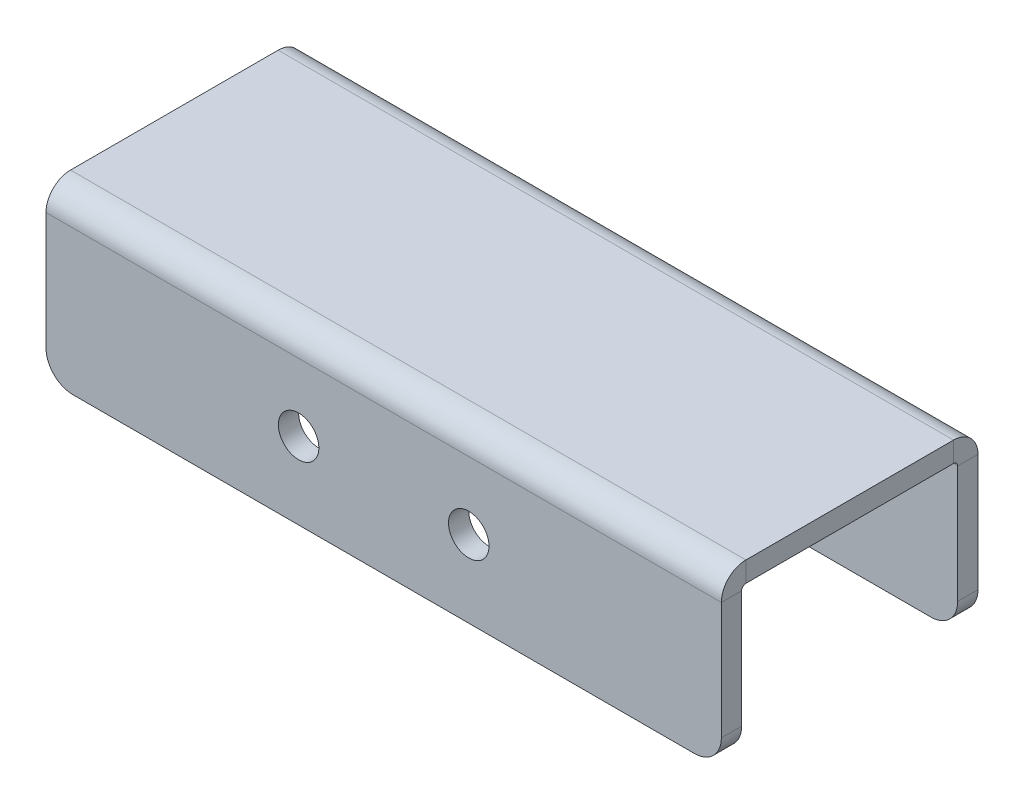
ISO-10303-21;
HEADER;
FILE_DESCRIPTION(('STEP AP214'),'2;1');
FILE_NAME('part.step','',(''),(''),'','','');
FILE_SCHEMA(('AUTOMOTIVE_DESIGN { 1 0 10303 214 1 1 1 1 }'));
ENDSEC;
DATA;
#1=APPLICATION_CONTEXT('core data for automotive mechanical design processes');
#2=APPLICATION_PROTOCOL_DEFINITION('international standard','automotive_design',2000,#1);
#3=PRODUCT_CONTEXT('',#1,'mechanical');
#4=PRODUCT('Part','Part','',(#3));
#5=PRODUCT_RELATED_PRODUCT_CATEGORY('part','',(#4));
#6=PRODUCT_DEFINITION_FORMATION('','',#4);
#7=PRODUCT_DEFINITION_CONTEXT('part definition',#1,'design');
#8=PRODUCT_DEFINITION('design','',#6,#7);
#9=PRODUCT_DEFINITION_SHAPE('','',#8);
#10=(LENGTH_UNIT() NAMED_UNIT(*) SI_UNIT(.MILLI.,.METRE.));
#11=(NAMED_UNIT(*) PLANE_ANGLE_UNIT() SI_UNIT($,.RADIAN.));
#12=(NAMED_UNIT(*) SI_UNIT($,.STERADIAN.) SOLID_ANGLE_UNIT());
#13=UNCERTAINTY_MEASURE_WITH_UNIT(LENGTH_MEASURE(1.E-05),#10,'distance_accuracy_value','');
#14=(GEOMETRIC_REPRESENTATION_CONTEXT(3) GLOBAL_UNCERTAINTY_ASSIGNED_CONTEXT((#13)) GLOBAL_UNIT_ASSIGNED_CONTEXT((#10,
#11,#12)) REPRESENTATION_CONTEXT('',''));
#15=CARTESIAN_POINT('',(0.,0.,0.));
#16=DIRECTION('',(0.,0.,1.));
#17=DIRECTION('',(1.,0.,0.));
#18=AXIS2_PLACEMENT_3D('',#15,#16,#17);
#19=CARTESIAN_POINT('',(414.617830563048,4.09724696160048,365.123365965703));
#20=DIRECTION('',(0.,0.,-1.));
#21=DIRECTION('',(0.,1.,0.));
#22=AXIS2_PLACEMENT_3D('',#19,#20,#21);
#23=CYLINDRICAL_SURFACE('',#22,6.35);
#24=DIRECTION('',(0.,0.,-1.));
#25=VECTOR('',#24,1.);
#26=CARTESIAN_POINT('',(414.617830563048,-2.25275303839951,365.123365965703));
#27=LINE('',#26,#25);
#28=CARTESIAN_POINT('',(414.617830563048,-2.25275303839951,45.2170000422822));
#29=VERTEX_POINT('',#28);
#30=CARTESIAN_POINT('',(414.617830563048,-2.25275303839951,40.4545000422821));
#31=VERTEX_POINT('',#30);
#32=EDGE_CURVE('E208',#29,#31,#27,.T.);
#33=ORIENTED_EDGE('',*,*,#32,.T.);
#34=CARTESIAN_POINT('',(414.617830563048,4.09724696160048,40.4545000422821));
#35=DIRECTION('',(0.,0.,1.));
#36=DIRECTION('',(1.,0.,0.));
#37=AXIS2_PLACEMENT_3D('',#34,#35,#36);
#38=CIRCLE('',#37,6.35);
#39=CARTESIAN_POINT('',(420.967830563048,4.09724696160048,40.4545000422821));
#40=VERTEX_POINT('',#39);
#41=EDGE_CURVE('E198',#40,#31,#38,.F.);
#42=ORIENTED_EDGE('',*,*,#41,.F.);
#43=DIRECTION('',(0.,0.,-1.));
#44=VECTOR('',#43,1.);
#45=CARTESIAN_POINT('',(420.967830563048,4.09724696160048,365.123365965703));
#46=LINE('',#45,#44);
#47=CARTESIAN_POINT('',(420.967830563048,4.09724696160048,45.2170000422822));
#48=VERTEX_POINT('',#47);
#49=EDGE_CURVE('E313',#48,#40,#46,.T.);
#50=ORIENTED_EDGE('',*,*,#49,.F.);
#51=CARTESIAN_POINT('',(414.617830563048,4.09724696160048,45.2170000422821));
#52=DIRECTION('',(0.,0.,1.));
#53=DIRECTION('',(1.,0.,0.));
#54=AXIS2_PLACEMENT_3D('',#51,#52,#53);
#55=CIRCLE('',#54,6.35);
#56=EDGE_CURVE('E305',#29,#48,#55,.T.);
#57=ORIENTED_EDGE('',*,*,#56,.F.);
#58=EDGE_LOOP('',(#33,#42,#50,#57));
#59=FACE_BOUND('',#58,.T.);
#60=ADVANCED_FACE('F38',(#59),#23,.T.);
#61=CARTESIAN_POINT('',(420.967830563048,-2.25275303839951,365.123365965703));
#62=DIRECTION('',(0.,-1.,0.));
#63=DIRECTION('',(0.,0.,-1.));
#64=AXIS2_PLACEMENT_3D('',#61,#62,#63);
#65=PLANE('',#64);
#66=DIRECTION('',(-1.,0.,0.));
#67=VECTOR('',#66,1.);
#68=CARTESIAN_POINT('',(420.967830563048,-2.25275303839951,40.4545000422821));
#69=LINE('',#68,#67);
#70=CARTESIAN_POINT('',(268.567830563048,-2.25275303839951,40.4545000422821));
#71=VERTEX_POINT('',#70);
#72=EDGE_CURVE('E317',#31,#71,#69,.T.);
#73=ORIENTED_EDGE('',*,*,#72,.F.);
#74=ORIENTED_EDGE('',*,*,#32,.F.);
#75=DIRECTION('',(-1.,0.,0.));
#76=VECTOR('',#75,1.);
#77=CARTESIAN_POINT('',(420.967830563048,-2.25275303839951,45.2170000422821));
#78=LINE('',#77,#76);
#79=CARTESIAN_POINT('',(268.567830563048,-2.25275303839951,45.2170000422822));
#80=VERTEX_POINT('',#79);
#81=EDGE_CURVE('E328',#29,#80,#78,.T.);
#82=ORIENTED_EDGE('',*,*,#81,.T.);
#83=DIRECTION('',(0.,0.,-1.));
#84=VECTOR('',#83,1.);
#85=CARTESIAN_POINT('',(268.567830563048,-2.25275303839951,365.123365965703));
#86=LINE('',#85,#84);
#87=EDGE_CURVE('E324',#80,#71,#86,.T.);
#88=ORIENTED_EDGE('',*,*,#87,.T.);
#89=EDGE_LOOP('',(#73,#74,#82,#88));
#90=FACE_BOUND('',#89,.T.);
#91=ADVANCED_FACE('F408',(#90),#65,.T.);
#92=CARTESIAN_POINT('',(321.592870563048,15.7972469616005,100.779500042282));
#93=DIRECTION('',(0.,0.,1.));
#94=DIRECTION('',(1.,0.,0.));
#95=AXIS2_PLACEMENT_3D('',#92,#93,#94);
#96=CYLINDRICAL_SURFACE('',#95,4.76186499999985);
#97=CARTESIAN_POINT('',(321.592870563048,15.7972469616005,45.2170000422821));
#98=DIRECTION('',(0.,0.,1.));
#99=DIRECTION('',(1.,0.,0.));
#100=AXIS2_PLACEMENT_3D('',#97,#98,#99);
#101=CIRCLE('',#100,4.76186499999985);
#102=CARTESIAN_POINT('',(326.354735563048,15.7972469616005,45.2170000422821));
#103=VERTEX_POINT('',#102);
#104=EDGE_CURVE('E327',#103,#103,#101,.T.);
#105=ORIENTED_EDGE('',*,*,#104,.T.);
#106=EDGE_LOOP('',(#105));
#107=FACE_BOUND('',#106,.T.);
#108=CARTESIAN_POINT('',(321.592870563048,15.7972469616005,40.4545000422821));
#109=DIRECTION('',(0.,0.,1.));
#110=DIRECTION('',(1.,0.,0.));
#111=AXIS2_PLACEMENT_3D('',#108,#109,#110);
#112=CIRCLE('',#111,4.76186499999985);
#113=CARTESIAN_POINT('',(326.354735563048,15.7972469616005,40.4545000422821));
#114=VERTEX_POINT('',#113);
#115=EDGE_CURVE('E318',#114,#114,#112,.T.);
#116=ORIENTED_EDGE('',*,*,#115,.F.);
#117=EDGE_LOOP('',(#116));
#118=FACE_BOUND('',#117,.T.);
#119=ADVANCED_FACE('F414',(#107,#118),#96,.F.);
#120=CARTESIAN_POINT('',(361.592790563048,15.7972469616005,100.779500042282));
#121=DIRECTION('',(0.,0.,1.));
#122=DIRECTION('',(1.,0.,0.));
#123=AXIS2_PLACEMENT_3D('',#120,#121,#122);
#124=CYLINDRICAL_SURFACE('',#123,4.76186499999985);
#125=CARTESIAN_POINT('',(361.592790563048,15.7972469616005,45.2170000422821));
#126=DIRECTION('',(0.,0.,1.));
#127=DIRECTION('',(1.,0.,0.));
#128=AXIS2_PLACEMENT_3D('',#125,#126,#127);
#129=CIRCLE('',#128,4.76186499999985);
#130=CARTESIAN_POINT('',(366.354655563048,15.7972469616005,45.2170000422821));
#131=VERTEX_POINT('',#130);
#132=EDGE_CURVE('E323',#131,#131,#129,.T.);
#133=ORIENTED_EDGE('',*,*,#132,.T.);
#134=EDGE_LOOP('',(#133));
#135=FACE_BOUND('',#134,.T.);
#136=CARTESIAN_POINT('',(361.592790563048,15.7972469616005,40.4545000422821));
#137=DIRECTION('',(0.,0.,1.));
#138=DIRECTION('',(1.,0.,0.));
#139=AXIS2_PLACEMENT_3D('',#136,#137,#138);
#140=CIRCLE('',#139,4.76186499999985);
#141=CARTESIAN_POINT('',(366.354655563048,15.7972469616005,40.4545000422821));
#142=VERTEX_POINT('',#141);
#143=EDGE_CURVE('E42',#142,#142,#140,.T.);
#144=ORIENTED_EDGE('',*,*,#143,.F.);
#145=EDGE_LOOP('',(#144));
#146=FACE_BOUND('',#145,.T.);
#147=ADVANCED_FACE('F349',(#135,#146),#124,.F.);
#148=CARTESIAN_POINT('',(268.567830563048,4.09724696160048,365.123365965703));
#149=DIRECTION('',(0.,0.,-1.));
#150=DIRECTION('',(0.,1.,0.));
#151=AXIS2_PLACEMENT_3D('',#148,#149,#150);
#152=CYLINDRICAL_SURFACE('',#151,6.35);
#153=DIRECTION('',(0.,0.,-1.));
#154=VECTOR('',#153,1.);
#155=CARTESIAN_POINT('',(262.217830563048,4.09724696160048,365.123365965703));
#156=LINE('',#155,#154);
#157=CARTESIAN_POINT('',(262.217830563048,4.09724696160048,45.2170000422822));
#158=VERTEX_POINT('',#157);
#159=CARTESIAN_POINT('',(262.217830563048,4.09724696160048,40.4545000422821));
#160=VERTEX_POINT('',#159);
#161=EDGE_CURVE('E321',#158,#160,#156,.T.);
#162=ORIENTED_EDGE('',*,*,#161,.T.);
#163=CARTESIAN_POINT('',(268.567830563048,4.09724696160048,40.4545000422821));
#164=DIRECTION('',(0.,0.,1.));
#165=DIRECTION('',(1.,0.,0.));
#166=AXIS2_PLACEMENT_3D('',#163,#164,#165);
#167=CIRCLE('',#166,6.35);
#168=EDGE_CURVE('E197',#71,#160,#167,.F.);
#169=ORIENTED_EDGE('',*,*,#168,.F.);
#170=ORIENTED_EDGE('',*,*,#87,.F.);
#171=CARTESIAN_POINT('',(268.567830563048,4.09724696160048,45.2170000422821));
#172=DIRECTION('',(0.,0.,1.));
#173=DIRECTION('',(1.,0.,0.));
#174=AXIS2_PLACEMENT_3D('',#171,#172,#173);
#175=CIRCLE('',#174,6.35);
#176=EDGE_CURVE('E308',#158,#80,#175,.T.);
#177=ORIENTED_EDGE('',*,*,#176,.F.);
#178=EDGE_LOOP('',(#162,#169,#170,#177));
#179=FACE_BOUND('',#178,.T.);
#180=ADVANCED_FACE('F420',(#179),#152,.T.);
#181=CARTESIAN_POINT('',(262.217830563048,-2.25275303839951,365.123365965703));
#182=DIRECTION('',(-1.,0.,0.));
#183=DIRECTION('',(0.,1.,0.));
#184=AXIS2_PLACEMENT_3D('',#181,#182,#183);
#185=PLANE('',#184);
#186=DIRECTION('',(0.,1.,0.));
#187=VECTOR('',#186,1.);
#188=CARTESIAN_POINT('',(262.217830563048,-2.25275303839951,40.4545000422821));
#189=LINE('',#188,#187);
#190=CARTESIAN_POINT('',(262.217830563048,31.6722469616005,40.4545000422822));
#191=VERTEX_POINT('',#190);
#192=EDGE_CURVE('E185',#160,#191,#189,.T.);
#193=ORIENTED_EDGE('',*,*,#192,.F.);
#194=ORIENTED_EDGE('',*,*,#161,.F.);
#195=DIRECTION('',(0.,1.,0.));
#196=VECTOR('',#195,1.);
#197=CARTESIAN_POINT('',(262.217830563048,-2.25275303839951,45.2170000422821));
#198=LINE('',#197,#196);
#199=CARTESIAN_POINT('',(262.217830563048,31.6722469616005,45.2170000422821));
#200=VERTEX_POINT('',#199);
#201=EDGE_CURVE('E94',#158,#200,#198,.T.);
#202=ORIENTED_EDGE('',*,*,#201,.T.);
#203=DIRECTION('',(0.,0.,-1.));
#204=VECTOR('',#203,1.);
#205=CARTESIAN_POINT('',(262.217830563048,31.6722469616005,365.123365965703));
#206=LINE('',#205,#204);
#207=EDGE_CURVE('E182',#200,#191,#206,.T.);
#208=ORIENTED_EDGE('',*,*,#207,.T.);
#209=EDGE_LOOP('',(#193,#194,#202,#208));
#210=FACE_BOUND('',#209,.T.);
#211=ADVANCED_FACE('F184',(#210),#185,.T.);
#212=CARTESIAN_POINT('',(420.967830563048,-2.25275303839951,40.4545000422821));
#213=DIRECTION('',(0.,0.,1.));
#214=DIRECTION('',(1.,0.,0.));
#215=AXIS2_PLACEMENT_3D('',#212,#213,#214);
#216=PLANE('',#215);
#217=ORIENTED_EDGE('',*,*,#143,.T.);
#218=EDGE_LOOP('',(#217));
#219=FACE_BOUND('',#218,.T.);
#220=ORIENTED_EDGE('',*,*,#115,.T.);
#221=EDGE_LOOP('',(#220));
#222=FACE_BOUND('',#221,.T.);
#223=ORIENTED_EDGE('',*,*,#72,.T.);
#224=ORIENTED_EDGE('',*,*,#168,.T.);
#225=ORIENTED_EDGE('',*,*,#192,.T.);
#226=DIRECTION('',(-1.,0.,0.));
#227=VECTOR('',#226,1.);
#228=CARTESIAN_POINT('',(420.967830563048,31.6722469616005,40.4545000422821));
#229=LINE('',#228,#227);
#230=CARTESIAN_POINT('',(420.967830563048,31.6722469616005,40.4545000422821));
#231=VERTEX_POINT('',#230);
#232=EDGE_CURVE('E195',#231,#191,#229,.T.);
#233=ORIENTED_EDGE('',*,*,#232,.F.);
#234=DIRECTION('',(0.,1.,0.));
#235=VECTOR('',#234,1.);
#236=CARTESIAN_POINT('',(420.967830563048,-2.25275303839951,40.4545000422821));
#237=LINE('',#236,#235);
#238=EDGE_CURVE('E311',#40,#231,#237,.T.);
#239=ORIENTED_EDGE('',*,*,#238,.F.);
#240=ORIENTED_EDGE('',*,*,#41,.T.);
#241=EDGE_LOOP('',(#223,#224,#225,#233,#239,#240));
#242=FACE_BOUND('',#241,.T.);
#243=ADVANCED_FACE('F194',(#219,#222,#242),#216,.F.);
#244=CARTESIAN_POINT('',(420.967830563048,-2.25275303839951,365.123365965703));
#245=DIRECTION('',(-1.,0.,0.));
#246=DIRECTION('',(0.,1.,0.));
#247=AXIS2_PLACEMENT_3D('',#244,#245,#246);
#248=PLANE('',#247);
#249=ORIENTED_EDGE('',*,*,#49,.T.);
#250=ORIENTED_EDGE('',*,*,#238,.T.);
#251=DIRECTION('',(0.,0.,-1.));
#252=VECTOR('',#251,1.);
#253=CARTESIAN_POINT('',(420.967830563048,31.6722469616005,365.123365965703));
#254=LINE('',#253,#252);
#255=CARTESIAN_POINT('',(420.967830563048,31.6722469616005,45.2170000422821));
#256=VERTEX_POINT('',#255);
#257=EDGE_CURVE('E87',#256,#231,#254,.T.);
#258=ORIENTED_EDGE('',*,*,#257,.F.);
#259=DIRECTION('',(0.,1.,0.));
#260=VECTOR('',#259,1.);
#261=CARTESIAN_POINT('',(420.967830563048,-2.25275303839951,45.2170000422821));
#262=LINE('',#261,#260);
#263=EDGE_CURVE('E48',#48,#256,#262,.T.);
#264=ORIENTED_EDGE('',*,*,#263,.F.);
#265=EDGE_LOOP('',(#249,#250,#258,#264));
#266=FACE_BOUND('',#265,.T.);
#267=ADVANCED_FACE('F356',(#266),#248,.F.);
#268=CARTESIAN_POINT('',(420.967830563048,-2.25275303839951,45.2170000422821));
#269=DIRECTION('',(0.,0.,1.));
#270=DIRECTION('',(1.,0.,0.));
#271=AXIS2_PLACEMENT_3D('',#268,#269,#270);
#272=PLANE('',#271);
#273=ORIENTED_EDGE('',*,*,#132,.F.);
#274=EDGE_LOOP('',(#273));
#275=FACE_BOUND('',#274,.T.);
#276=ORIENTED_EDGE('',*,*,#104,.F.);
#277=EDGE_LOOP('',(#276));
#278=FACE_BOUND('',#277,.T.);
#279=ORIENTED_EDGE('',*,*,#201,.F.);
#280=ORIENTED_EDGE('',*,*,#176,.T.);
#281=ORIENTED_EDGE('',*,*,#81,.F.);
#282=ORIENTED_EDGE('',*,*,#56,.T.);
#283=ORIENTED_EDGE('',*,*,#263,.T.);
#284=DIRECTION('',(-1.,0.,0.));
#285=VECTOR('',#284,1.);
#286=CARTESIAN_POINT('',(420.967830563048,31.6722469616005,45.2170000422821));
#287=LINE('',#286,#285);
#288=EDGE_CURVE('E12',#256,#200,#287,.T.);
#289=ORIENTED_EDGE('',*,*,#288,.T.);
#290=EDGE_LOOP('',(#279,#280,#281,#282,#283,#289));
#291=FACE_BOUND('',#290,.T.);
#292=ADVANCED_FACE('F352',(#275,#278,#291),#272,.T.);
#293=CARTESIAN_POINT('',(420.967830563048,-2.25275303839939,-223.889365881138));
#294=DIRECTION('',(0.,1.,0.));
#295=DIRECTION('',(0.,0.,1.));
#296=AXIS2_PLACEMENT_3D('',#293,#294,#295);
#297=PLANE('',#296);
#298=DIRECTION('',(0.,0.,1.));
#299=VECTOR('',#298,1.);
#300=CARTESIAN_POINT('',(414.617830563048,-2.25275303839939,-223.889365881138));
#301=LINE('',#300,#299);
#302=CARTESIAN_POINT('',(414.617830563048,-2.25275303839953,96.0170000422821));
#303=VERTEX_POINT('',#302);
#304=CARTESIAN_POINT('',(414.617830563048,-2.25275303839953,100.779500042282));
#305=VERTEX_POINT('',#304);
#306=EDGE_CURVE('E129',#303,#305,#301,.T.);
#307=ORIENTED_EDGE('',*,*,#306,.T.);
#308=DIRECTION('',(-1.,0.,0.));
#309=VECTOR('',#308,1.);
#310=CARTESIAN_POINT('',(420.967830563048,-2.25275303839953,100.779500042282));
#311=LINE('',#310,#309);
#312=CARTESIAN_POINT('',(268.567830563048,-2.25275303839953,100.779500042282));
#313=VERTEX_POINT('',#312);
#314=EDGE_CURVE('E296',#305,#313,#311,.T.);
#315=ORIENTED_EDGE('',*,*,#314,.T.);
#316=DIRECTION('',(0.,0.,1.));
#317=VECTOR('',#316,1.);
#318=CARTESIAN_POINT('',(268.567830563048,-2.25275303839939,-223.889365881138));
#319=LINE('',#318,#317);
#320=CARTESIAN_POINT('',(268.567830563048,-2.25275303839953,96.0170000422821));
#321=VERTEX_POINT('',#320);
#322=EDGE_CURVE('E293',#321,#313,#319,.T.);
#323=ORIENTED_EDGE('',*,*,#322,.F.);
#324=DIRECTION('',(-1.,0.,0.));
#325=VECTOR('',#324,1.);
#326=CARTESIAN_POINT('',(420.967830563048,-2.25275303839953,96.0170000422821));
#327=LINE('',#326,#325);
#328=EDGE_CURVE('E268',#303,#321,#327,.T.);
#329=ORIENTED_EDGE('',*,*,#328,.F.);
#330=EDGE_LOOP('',(#307,#315,#323,#329));
#331=FACE_BOUND('',#330,.T.);
#332=ADVANCED_FACE('F355',(#331),#297,.F.);
#333=CARTESIAN_POINT('',(268.567830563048,4.0972469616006,-223.889365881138));
#334=DIRECTION('',(0.,0.,1.));
#335=DIRECTION('',(0.,-1.,0.));
#336=AXIS2_PLACEMENT_3D('',#333,#334,#335);
#337=CYLINDRICAL_SURFACE('',#336,6.35);
#338=ORIENTED_EDGE('',*,*,#322,.T.);
#339=CARTESIAN_POINT('',(268.567830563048,4.09724696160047,100.779500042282));
#340=DIRECTION('',(0.,0.,-1.));
#341=DIRECTION('',(0.,1.,0.));
#342=AXIS2_PLACEMENT_3D('',#339,#340,#341);
#343=CIRCLE('',#342,6.35);
#344=CARTESIAN_POINT('',(262.217830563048,4.09724696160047,100.779500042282));
#345=VERTEX_POINT('',#344);
#346=EDGE_CURVE('E279',#345,#313,#343,.F.);
#347=ORIENTED_EDGE('',*,*,#346,.F.);
#348=DIRECTION('',(0.,0.,1.));
#349=VECTOR('',#348,1.);
#350=CARTESIAN_POINT('',(262.217830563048,4.0972469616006,-223.889365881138));
#351=LINE('',#350,#349);
#352=CARTESIAN_POINT('',(262.217830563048,4.09724696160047,96.0170000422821));
#353=VERTEX_POINT('',#352);
#354=EDGE_CURVE('E271',#353,#345,#351,.T.);
#355=ORIENTED_EDGE('',*,*,#354,.F.);
#356=CARTESIAN_POINT('',(268.567830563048,4.09724696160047,96.0170000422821));
#357=DIRECTION('',(0.,0.,-1.));
#358=DIRECTION('',(0.,1.,0.));
#359=AXIS2_PLACEMENT_3D('',#356,#357,#358);
#360=CIRCLE('',#359,6.35);
#361=EDGE_CURVE('E135',#321,#353,#360,.T.);
#362=ORIENTED_EDGE('',*,*,#361,.F.);
#363=EDGE_LOOP('',(#338,#347,#355,#362));
#364=FACE_BOUND('',#363,.T.);
#365=ADVANCED_FACE('F394',(#364),#337,.T.);
#366=CARTESIAN_POINT('',(321.592870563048,15.7972469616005,100.779500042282));
#367=DIRECTION('',(0.,0.,1.));
#368=DIRECTION('',(1.,0.,0.));
#369=AXIS2_PLACEMENT_3D('',#366,#367,#368);
#370=CYLINDRICAL_SURFACE('',#369,4.76186499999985);
#371=CARTESIAN_POINT('',(321.592870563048,15.7972469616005,96.0170000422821));
#372=DIRECTION('',(0.,0.,-1.));
#373=DIRECTION('',(0.,1.,0.));
#374=AXIS2_PLACEMENT_3D('',#371,#372,#373);
#375=CIRCLE('',#374,4.76186499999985);
#376=CARTESIAN_POINT('',(326.354735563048,15.7972469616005,96.0170000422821));
#377=VERTEX_POINT('',#376);
#378=EDGE_CURVE('E295',#377,#377,#375,.T.);
#379=CARTESIAN_POINT('',(321.592870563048,15.7972469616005,100.779500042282));
#380=DIRECTION('',(0.,0.,-1.));
#381=DIRECTION('',(0.,1.,0.));
#382=AXIS2_PLACEMENT_3D('',#379,#380,#381);
#383=CIRCLE('',#382,4.76186499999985);
#384=CARTESIAN_POINT('',(326.354735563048,15.7972469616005,100.779500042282));
#385=VERTEX_POINT('',#384);
#386=EDGE_CURVE('E339',#385,#385,#383,.F.);
#387=CARTESIAN_POINT('',(326.354735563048,15.7972469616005,96.0170000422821));
#388=CARTESIAN_POINT('',(326.354735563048,15.7972469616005,96.0666094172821));
#389=CARTESIAN_POINT('',(326.354735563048,15.7972469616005,96.1162187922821));
#390=CARTESIAN_POINT('',(326.354735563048,15.7972469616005,96.2154375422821));
#391=CARTESIAN_POINT('',(326.354735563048,15.7972469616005,96.2650469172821));
#392=CARTESIAN_POINT('',(326.354735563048,15.7972469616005,96.3642656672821));
#393=CARTESIAN_POINT('',(326.354735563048,15.7972469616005,96.4138750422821));
#394=CARTESIAN_POINT('',(326.354735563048,15.7972469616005,96.5130937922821));
#395=CARTESIAN_POINT('',(326.354735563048,15.7972469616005,96.5627031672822));
#396=CARTESIAN_POINT('',(326.354735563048,15.7972469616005,96.6619219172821));
#397=CARTESIAN_POINT('',(326.354735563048,15.7972469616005,96.7115312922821));
#398=CARTESIAN_POINT('',(326.354735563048,15.7972469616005,96.8107500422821));
#399=CARTESIAN_POINT('',(326.354735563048,15.7972469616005,96.8603594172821));
#400=CARTESIAN_POINT('',(326.354735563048,15.7972469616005,96.9595781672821));
#401=CARTESIAN_POINT('',(326.354735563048,15.7972469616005,97.0091875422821));
#402=CARTESIAN_POINT('',(326.354735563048,15.7972469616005,97.1084062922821));
#403=CARTESIAN_POINT('',(326.354735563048,15.7972469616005,97.1580156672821));
#404=CARTESIAN_POINT('',(326.354735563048,15.7972469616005,97.2572344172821));
#405=CARTESIAN_POINT('',(326.354735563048,15.7972469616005,97.3068437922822));
#406=CARTESIAN_POINT('',(326.354735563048,15.7972469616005,97.4060625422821));
#407=CARTESIAN_POINT('',(326.354735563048,15.7972469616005,97.4556719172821));
#408=CARTESIAN_POINT('',(326.354735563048,15.7972469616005,97.5548906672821));
#409=CARTESIAN_POINT('',(326.354735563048,15.7972469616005,97.6045000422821));
#410=CARTESIAN_POINT('',(326.354735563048,15.7972469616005,97.7037187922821));
#411=CARTESIAN_POINT('',(326.354735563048,15.7972469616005,97.7533281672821));
#412=CARTESIAN_POINT('',(326.354735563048,15.7972469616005,97.8525469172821));
#413=CARTESIAN_POINT('',(326.354735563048,15.7972469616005,97.9021562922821));
#414=CARTESIAN_POINT('',(326.354735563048,15.7972469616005,98.0013750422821));
#415=CARTESIAN_POINT('',(326.354735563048,15.7972469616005,98.0509844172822));
#416=CARTESIAN_POINT('',(326.354735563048,15.7972469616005,98.1502031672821));
#417=CARTESIAN_POINT('',(326.354735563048,15.7972469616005,98.1998125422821));
#418=CARTESIAN_POINT('',(326.354735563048,15.7972469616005,98.2990312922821));
#419=CARTESIAN_POINT('',(326.354735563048,15.7972469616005,98.3486406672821));
#420=CARTESIAN_POINT('',(326.354735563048,15.7972469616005,98.4478594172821));
#421=CARTESIAN_POINT('',(326.354735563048,15.7972469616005,98.4974687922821));
#422=CARTESIAN_POINT('',(326.354735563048,15.7972469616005,98.5966875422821));
#423=CARTESIAN_POINT('',(326.354735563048,15.7972469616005,98.6462969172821));
#424=CARTESIAN_POINT('',(326.354735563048,15.7972469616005,98.7455156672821));
#425=CARTESIAN_POINT('',(326.354735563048,15.7972469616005,98.7951250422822));
#426=CARTESIAN_POINT('',(326.354735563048,15.7972469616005,98.8943437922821));
#427=CARTESIAN_POINT('',(326.354735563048,15.7972469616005,98.9439531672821));
#428=CARTESIAN_POINT('',(326.354735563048,15.7972469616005,99.0431719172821));
#429=CARTESIAN_POINT('',(326.354735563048,15.7972469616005,99.0927812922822));
#430=CARTESIAN_POINT('',(326.354735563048,15.7972469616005,99.1920000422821));
#431=CARTESIAN_POINT('',(326.354735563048,15.7972469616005,99.2416094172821));
#432=CARTESIAN_POINT('',(326.354735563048,15.7972469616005,99.3408281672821));
#433=CARTESIAN_POINT('',(326.354735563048,15.7972469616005,99.3904375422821));
#434=CARTESIAN_POINT('',(326.354735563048,15.7972469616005,99.4896562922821));
#435=CARTESIAN_POINT('',(326.354735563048,15.7972469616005,99.5392656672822));
#436=CARTESIAN_POINT('',(326.354735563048,15.7972469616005,99.6384844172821));
#437=CARTESIAN_POINT('',(326.354735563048,15.7972469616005,99.6880937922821));
#438=CARTESIAN_POINT('',(326.354735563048,15.7972469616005,99.7873125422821));
#439=CARTESIAN_POINT('',(326.354735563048,15.7972469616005,99.8369219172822));
#440=CARTESIAN_POINT('',(326.354735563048,15.7972469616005,99.9361406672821));
#441=CARTESIAN_POINT('',(326.354735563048,15.7972469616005,99.9857500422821));
#442=CARTESIAN_POINT('',(326.354735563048,15.7972469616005,100.084968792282));
#443=CARTESIAN_POINT('',(326.354735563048,15.7972469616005,100.134578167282));
#444=CARTESIAN_POINT('',(326.354735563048,15.7972469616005,100.233796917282));
#445=CARTESIAN_POINT('',(326.354735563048,15.7972469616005,100.283406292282));
#446=CARTESIAN_POINT('',(326.354735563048,15.7972469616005,100.382625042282));
#447=CARTESIAN_POINT('',(326.354735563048,15.7972469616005,100.432234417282));
#448=CARTESIAN_POINT('',(326.354735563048,15.7972469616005,100.531453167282));
#449=CARTESIAN_POINT('',(326.354735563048,15.7972469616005,100.581062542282));
#450=CARTESIAN_POINT('',(326.354735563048,15.7972469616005,100.680281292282));
#451=CARTESIAN_POINT('',(326.354735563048,15.7972469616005,100.729890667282));
#452=CARTESIAN_POINT('',(326.354735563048,15.7972469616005,100.779500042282));
#453=B_SPLINE_CURVE_WITH_KNOTS('',3,(#387,#388,#389,#390,#391,#392,#393,#394,#395,#396,#397,
#398,#399,#400,#401,#402,#403,#404,#405,#406,#407,#408,#409,#410,#411,#412,#413,#414,#415,#416,
#417,#418,#419,#420,#421,#422,#423,#424,#425,#426,#427,#428,#429,#430,#431,#432,#433,#434,#435,
#436,#437,#438,#439,#440,#441,#442,#443,#444,#445,#446,#447,#448,#449,#450,#451,#452),
.UNSPECIFIED.,.F.,.F.,(4,2,2,2,2,2,2,2,2,2,2,2,2,2,2,2,2,2,2,2,2,2,2,2,2,2,2,2,2,2,2,2,4),(0.,
0.148828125,0.29765625,0.446484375,0.5953125,0.744140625,0.892968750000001,1.041796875,1.190625,
1.339453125,1.48828125,1.637109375,1.7859375,1.934765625,2.08359375,2.232421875,2.38125,
2.530078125,2.67890625,2.827734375,2.9765625,3.125390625,3.27421875,3.423046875,3.571875,
3.720703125,3.86953125,4.018359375,4.1671875,4.316015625,4.46484375,4.613671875,4.7625),.UNSPECIFIED.);
#454=EDGE_CURVE('BSEAM40',#377,#385,#453,.T.);
#455=ORIENTED_EDGE('',*,*,#378,.T.);
#456=ORIENTED_EDGE('',*,*,#386,.T.);
#457=ORIENTED_EDGE('',*,*,#454,.T.);
#458=ORIENTED_EDGE('',*,*,#454,.F.);
#459=EDGE_LOOP('',(#455,#457,#456,#458));
#460=FACE_BOUND('',#459,.T.);
#461=ADVANCED_FACE('F40',(#460),#370,.F.);
#462=CARTESIAN_POINT('',(361.592790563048,15.7972469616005,100.779500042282));
#463=DIRECTION('',(0.,0.,1.));
#464=DIRECTION('',(1.,0.,0.));
#465=AXIS2_PLACEMENT_3D('',#462,#463,#464);
#466=CYLINDRICAL_SURFACE('',#465,4.76186499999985);
#467=CARTESIAN_POINT('',(361.592790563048,15.7972469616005,96.0170000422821));
#468=DIRECTION('',(0.,0.,-1.));
#469=DIRECTION('',(0.,1.,0.));
#470=AXIS2_PLACEMENT_3D('',#467,#468,#469);
#471=CIRCLE('',#470,4.76186499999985);
#472=CARTESIAN_POINT('',(366.354655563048,15.7972469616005,96.0170000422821));
#473=VERTEX_POINT('',#472);
#474=EDGE_CURVE('E342',#473,#473,#471,.T.);
#475=CARTESIAN_POINT('',(361.592790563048,15.7972469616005,100.779500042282));
#476=DIRECTION('',(0.,0.,-1.));
#477=DIRECTION('',(0.,1.,0.));
#478=AXIS2_PLACEMENT_3D('',#475,#476,#477);
#479=CIRCLE('',#478,4.76186499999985);
#480=CARTESIAN_POINT('',(366.354655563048,15.7972469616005,100.779500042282));
#481=VERTEX_POINT('',#480);
#482=EDGE_CURVE('E292',#481,#481,#479,.F.);
#483=CARTESIAN_POINT('',(366.354655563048,15.7972469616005,96.0170000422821));
#484=CARTESIAN_POINT('',(366.354655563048,15.7972469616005,96.0666094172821));
#485=CARTESIAN_POINT('',(366.354655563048,15.7972469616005,96.1162187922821));
#486=CARTESIAN_POINT('',(366.354655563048,15.7972469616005,96.2154375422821));
#487=CARTESIAN_POINT('',(366.354655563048,15.7972469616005,96.2650469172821));
#488=CARTESIAN_POINT('',(366.354655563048,15.7972469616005,96.3642656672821));
#489=CARTESIAN_POINT('',(366.354655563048,15.7972469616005,96.4138750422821));
#490=CARTESIAN_POINT('',(366.354655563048,15.7972469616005,96.5130937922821));
#491=CARTESIAN_POINT('',(366.354655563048,15.7972469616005,96.5627031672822));
#492=CARTESIAN_POINT('',(366.354655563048,15.7972469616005,96.6619219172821));
#493=CARTESIAN_POINT('',(366.354655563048,15.7972469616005,96.7115312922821));
#494=CARTESIAN_POINT('',(366.354655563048,15.7972469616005,96.8107500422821));
#495=CARTESIAN_POINT('',(366.354655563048,15.7972469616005,96.8603594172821));
#496=CARTESIAN_POINT('',(366.354655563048,15.7972469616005,96.9595781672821));
#497=CARTESIAN_POINT('',(366.354655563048,15.7972469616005,97.0091875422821));
#498=CARTESIAN_POINT('',(366.354655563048,15.7972469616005,97.1084062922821));
#499=CARTESIAN_POINT('',(366.354655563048,15.7972469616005,97.1580156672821));
#500=CARTESIAN_POINT('',(366.354655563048,15.7972469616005,97.2572344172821));
#501=CARTESIAN_POINT('',(366.354655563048,15.7972469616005,97.3068437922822));
#502=CARTESIAN_POINT('',(366.354655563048,15.7972469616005,97.4060625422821));
#503=CARTESIAN_POINT('',(366.354655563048,15.7972469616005,97.4556719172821));
#504=CARTESIAN_POINT('',(366.354655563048,15.7972469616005,97.5548906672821));
#505=CARTESIAN_POINT('',(366.354655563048,15.7972469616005,97.6045000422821));
#506=CARTESIAN_POINT('',(366.354655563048,15.7972469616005,97.7037187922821));
#507=CARTESIAN_POINT('',(366.354655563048,15.7972469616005,97.7533281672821));
#508=CARTESIAN_POINT('',(366.354655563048,15.7972469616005,97.8525469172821));
#509=CARTESIAN_POINT('',(366.354655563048,15.7972469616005,97.9021562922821));
#510=CARTESIAN_POINT('',(366.354655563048,15.7972469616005,98.0013750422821));
#511=CARTESIAN_POINT('',(366.354655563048,15.7972469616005,98.0509844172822));
#512=CARTESIAN_POINT('',(366.354655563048,15.7972469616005,98.1502031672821));
#513=CARTESIAN_POINT('',(366.354655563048,15.7972469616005,98.1998125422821));
#514=CARTESIAN_POINT('',(366.354655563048,15.7972469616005,98.2990312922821));
#515=CARTESIAN_POINT('',(366.354655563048,15.7972469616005,98.3486406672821));
#516=CARTESIAN_POINT('',(366.354655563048,15.7972469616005,98.4478594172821));
#517=CARTESIAN_POINT('',(366.354655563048,15.7972469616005,98.4974687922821));
#518=CARTESIAN_POINT('',(366.354655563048,15.7972469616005,98.5966875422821));
#519=CARTESIAN_POINT('',(366.354655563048,15.7972469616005,98.6462969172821));
#520=CARTESIAN_POINT('',(366.354655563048,15.7972469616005,98.7455156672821));
#521=CARTESIAN_POINT('',(366.354655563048,15.7972469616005,98.7951250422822));
#522=CARTESIAN_POINT('',(366.354655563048,15.7972469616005,98.8943437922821));
#523=CARTESIAN_POINT('',(366.354655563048,15.7972469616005,98.9439531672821));
#524=CARTESIAN_POINT('',(366.354655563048,15.7972469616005,99.0431719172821));
#525=CARTESIAN_POINT('',(366.354655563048,15.7972469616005,99.0927812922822));
#526=CARTESIAN_POINT('',(366.354655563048,15.7972469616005,99.1920000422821));
#527=CARTESIAN_POINT('',(366.354655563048,15.7972469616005,99.2416094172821));
#528=CARTESIAN_POINT('',(366.354655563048,15.7972469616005,99.3408281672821));
#529=CARTESIAN_POINT('',(366.354655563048,15.7972469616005,99.3904375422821));
#530=CARTESIAN_POINT('',(366.354655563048,15.7972469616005,99.4896562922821));
#531=CARTESIAN_POINT('',(366.354655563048,15.7972469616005,99.5392656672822));
#532=CARTESIAN_POINT('',(366.354655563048,15.7972469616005,99.6384844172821));
#533=CARTESIAN_POINT('',(366.354655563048,15.7972469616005,99.6880937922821));
#534=CARTESIAN_POINT('',(366.354655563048,15.7972469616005,99.7873125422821));
#535=CARTESIAN_POINT('',(366.354655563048,15.7972469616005,99.8369219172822));
#536=CARTESIAN_POINT('',(366.354655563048,15.7972469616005,99.9361406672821));
#537=CARTESIAN_POINT('',(366.354655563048,15.7972469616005,99.9857500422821));
#538=CARTESIAN_POINT('',(366.354655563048,15.7972469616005,100.084968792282));
#539=CARTESIAN_POINT('',(366.354655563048,15.7972469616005,100.134578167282));
#540=CARTESIAN_POINT('',(366.354655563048,15.7972469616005,100.233796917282));
#541=CARTESIAN_POINT('',(366.354655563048,15.7972469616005,100.283406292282));
#542=CARTESIAN_POINT('',(366.354655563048,15.7972469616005,100.382625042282));
#543=CARTESIAN_POINT('',(366.354655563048,15.7972469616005,100.432234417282));
#544=CARTESIAN_POINT('',(366.354655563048,15.7972469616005,100.531453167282));
#545=CARTESIAN_POINT('',(366.354655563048,15.7972469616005,100.581062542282));
#546=CARTESIAN_POINT('',(366.354655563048,15.7972469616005,100.680281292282));
#547=CARTESIAN_POINT('',(366.354655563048,15.7972469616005,100.729890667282));
#548=CARTESIAN_POINT('',(366.354655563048,15.7972469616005,100.779500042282));
#549=B_SPLINE_CURVE_WITH_KNOTS('',3,(#483,#484,#485,#486,#487,#488,#489,#490,#491,#492,#493,
#494,#495,#496,#497,#498,#499,#500,#501,#502,#503,#504,#505,#506,#507,#508,#509,#510,#511,#512,
#513,#514,#515,#516,#517,#518,#519,#520,#521,#522,#523,#524,#525,#526,#527,#528,#529,#530,#531,
#532,#533,#534,#535,#536,#537,#538,#539,#540,#541,#542,#543,#544,#545,#546,#547,#548),
.UNSPECIFIED.,.F.,.F.,(4,2,2,2,2,2,2,2,2,2,2,2,2,2,2,2,2,2,2,2,2,2,2,2,2,2,2,2,2,2,2,2,4),(0.,
0.148828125,0.29765625,0.446484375,0.5953125,0.744140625,0.892968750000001,1.041796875,1.190625,
1.339453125,1.48828125,1.637109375,1.7859375,1.934765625,2.08359375,2.232421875,2.38125,
2.530078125,2.67890625,2.827734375,2.9765625,3.125390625,3.27421875,3.423046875,3.571875,
3.720703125,3.86953125,4.018359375,4.1671875,4.316015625,4.46484375,4.613671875,4.7625),.UNSPECIFIED.);
#550=EDGE_CURVE('BSEAM398',#473,#481,#549,.T.);
#551=ORIENTED_EDGE('',*,*,#474,.T.);
#552=ORIENTED_EDGE('',*,*,#482,.T.);
#553=ORIENTED_EDGE('',*,*,#550,.T.);
#554=ORIENTED_EDGE('',*,*,#550,.F.);
#555=EDGE_LOOP('',(#551,#553,#552,#554));
#556=FACE_BOUND('',#555,.T.);
#557=ADVANCED_FACE('F398',(#556),#466,.F.);
#558=CARTESIAN_POINT('',(414.617830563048,4.0972469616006,-223.889365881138));
#559=DIRECTION('',(0.,0.,1.));
#560=DIRECTION('',(0.,-1.,0.));
#561=AXIS2_PLACEMENT_3D('',#558,#559,#560);
#562=CYLINDRICAL_SURFACE('',#561,6.35);
#563=DIRECTION('',(0.,0.,1.));
#564=VECTOR('',#563,1.);
#565=CARTESIAN_POINT('',(420.967830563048,4.0972469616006,-223.889365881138));
#566=LINE('',#565,#564);
#567=CARTESIAN_POINT('',(420.967830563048,4.09724696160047,96.0170000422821));
#568=VERTEX_POINT('',#567);
#569=CARTESIAN_POINT('',(420.967830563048,4.09724696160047,100.779500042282));
#570=VERTEX_POINT('',#569);
#571=EDGE_CURVE('E289',#568,#570,#566,.T.);
#572=ORIENTED_EDGE('',*,*,#571,.T.);
#573=CARTESIAN_POINT('',(414.617830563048,4.09724696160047,100.779500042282));
#574=DIRECTION('',(0.,0.,-1.));
#575=DIRECTION('',(0.,1.,0.));
#576=AXIS2_PLACEMENT_3D('',#573,#574,#575);
#577=CIRCLE('',#576,6.35);
#578=EDGE_CURVE('E277',#305,#570,#577,.F.);
#579=ORIENTED_EDGE('',*,*,#578,.F.);
#580=ORIENTED_EDGE('',*,*,#306,.F.);
#581=CARTESIAN_POINT('',(414.617830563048,4.09724696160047,96.0170000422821));
#582=DIRECTION('',(0.,0.,-1.));
#583=DIRECTION('',(0.,1.,0.));
#584=AXIS2_PLACEMENT_3D('',#581,#582,#583);
#585=CIRCLE('',#584,6.35);
#586=EDGE_CURVE('E261',#568,#303,#585,.T.);
#587=ORIENTED_EDGE('',*,*,#586,.F.);
#588=EDGE_LOOP('',(#572,#579,#580,#587));
#589=FACE_BOUND('',#588,.T.);
#590=ADVANCED_FACE('F396',(#589),#562,.T.);
#591=CARTESIAN_POINT('',(420.967830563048,31.6722469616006,-223.889365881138));
#592=DIRECTION('',(-1.,0.,0.));
#593=DIRECTION('',(0.,-1.,0.));
#594=AXIS2_PLACEMENT_3D('',#591,#592,#593);
#595=PLANE('',#594);
#596=DIRECTION('',(0.,0.,1.));
#597=VECTOR('',#596,1.);
#598=CARTESIAN_POINT('',(420.967830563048,31.6722469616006,-223.889365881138));
#599=LINE('',#598,#597);
#600=CARTESIAN_POINT('',(420.967830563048,31.6722469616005,96.0170000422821));
#601=VERTEX_POINT('',#600);
#602=CARTESIAN_POINT('',(420.967830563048,31.6722469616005,100.779500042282));
#603=VERTEX_POINT('',#602);
#604=EDGE_CURVE('E286',#601,#603,#599,.T.);
#605=ORIENTED_EDGE('',*,*,#604,.T.);
#606=DIRECTION('',(0.,-1.,0.));
#607=VECTOR('',#606,1.);
#608=CARTESIAN_POINT('',(420.967830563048,31.6722469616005,100.779500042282));
#609=LINE('',#608,#607);
#610=EDGE_CURVE('E283',#603,#570,#609,.T.);
#611=ORIENTED_EDGE('',*,*,#610,.T.);
#612=ORIENTED_EDGE('',*,*,#571,.F.);
#613=DIRECTION('',(0.,-1.,0.));
#614=VECTOR('',#613,1.);
#615=CARTESIAN_POINT('',(420.967830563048,31.6722469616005,96.0170000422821));
#616=LINE('',#615,#614);
#617=EDGE_CURVE('E264',#601,#568,#616,.T.);
#618=ORIENTED_EDGE('',*,*,#617,.F.);
#619=EDGE_LOOP('',(#605,#611,#612,#618));
#620=FACE_BOUND('',#619,.T.);
#621=ADVANCED_FACE('F384',(#620),#595,.F.);
#622=CARTESIAN_POINT('',(420.967830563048,31.6722469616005,100.779500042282));
#623=DIRECTION('',(0.,0.,-1.));
#624=DIRECTION('',(0.,1.,0.));
#625=AXIS2_PLACEMENT_3D('',#622,#623,#624);
#626=PLANE('',#625);
#627=ORIENTED_EDGE('',*,*,#482,.F.);
#628=EDGE_LOOP('',(#627));
#629=FACE_BOUND('',#628,.T.);
#630=ORIENTED_EDGE('',*,*,#386,.F.);
#631=EDGE_LOOP('',(#630));
#632=FACE_BOUND('',#631,.T.);
#633=DIRECTION('',(0.,-1.,0.));
#634=VECTOR('',#633,1.);
#635=CARTESIAN_POINT('',(262.217830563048,31.6722469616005,100.779500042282));
#636=LINE('',#635,#634);
#637=CARTESIAN_POINT('',(262.217830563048,31.6722469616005,100.779500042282));
#638=VERTEX_POINT('',#637);
#639=EDGE_CURVE('E281',#638,#345,#636,.T.);
#640=ORIENTED_EDGE('',*,*,#639,.T.);
#641=ORIENTED_EDGE('',*,*,#346,.T.);
#642=ORIENTED_EDGE('',*,*,#314,.F.);
#643=ORIENTED_EDGE('',*,*,#578,.T.);
#644=ORIENTED_EDGE('',*,*,#610,.F.);
#645=DIRECTION('',(-1.,0.,0.));
#646=VECTOR('',#645,1.);
#647=CARTESIAN_POINT('',(420.967830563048,31.6722469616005,100.779500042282));
#648=LINE('',#647,#646);
#649=EDGE_CURVE('E274',#603,#638,#648,.T.);
#650=ORIENTED_EDGE('',*,*,#649,.T.);
#651=EDGE_LOOP('',(#640,#641,#642,#643,#644,#650));
#652=FACE_BOUND('',#651,.T.);
#653=ADVANCED_FACE('F380',(#629,#632,#652),#626,.F.);
#654=CARTESIAN_POINT('',(262.217830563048,31.6722469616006,-223.889365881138));
#655=DIRECTION('',(-1.,0.,0.));
#656=DIRECTION('',(0.,-1.,0.));
#657=AXIS2_PLACEMENT_3D('',#654,#655,#656);
#658=PLANE('',#657);
#659=ORIENTED_EDGE('',*,*,#639,.F.);
#660=DIRECTION('',(0.,0.,1.));
#661=VECTOR('',#660,1.);
#662=CARTESIAN_POINT('',(262.217830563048,31.6722469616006,-223.889365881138));
#663=LINE('',#662,#661);
#664=CARTESIAN_POINT('',(262.217830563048,31.6722469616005,96.0170000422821));
#665=VERTEX_POINT('',#664);
#666=EDGE_CURVE('E300',#665,#638,#663,.T.);
#667=ORIENTED_EDGE('',*,*,#666,.F.);
#668=DIRECTION('',(0.,-1.,0.));
#669=VECTOR('',#668,1.);
#670=CARTESIAN_POINT('',(262.217830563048,31.6722469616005,96.0170000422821));
#671=LINE('',#670,#669);
#672=EDGE_CURVE('E102',#665,#353,#671,.T.);
#673=ORIENTED_EDGE('',*,*,#672,.T.);
#674=ORIENTED_EDGE('',*,*,#354,.T.);
#675=EDGE_LOOP('',(#659,#667,#673,#674));
#676=FACE_BOUND('',#675,.T.);
#677=ADVANCED_FACE('F392',(#676),#658,.T.);
#678=CARTESIAN_POINT('',(420.967830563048,31.6722469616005,96.0170000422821));
#679=DIRECTION('',(0.,0.,-1.));
#680=DIRECTION('',(0.,1.,0.));
#681=AXIS2_PLACEMENT_3D('',#678,#679,#680);
#682=PLANE('',#681);
#683=ORIENTED_EDGE('',*,*,#474,.F.);
#684=EDGE_LOOP('',(#683));
#685=FACE_BOUND('',#684,.T.);
#686=ORIENTED_EDGE('',*,*,#378,.F.);
#687=EDGE_LOOP('',(#686));
#688=FACE_BOUND('',#687,.T.);
#689=ORIENTED_EDGE('',*,*,#328,.T.);
#690=ORIENTED_EDGE('',*,*,#361,.T.);
#691=ORIENTED_EDGE('',*,*,#672,.F.);
#692=DIRECTION('',(-1.,0.,0.));
#693=VECTOR('',#692,1.);
#694=CARTESIAN_POINT('',(420.967830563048,31.6722469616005,96.0170000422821));
#695=LINE('',#694,#693);
#696=EDGE_CURVE('E260',#601,#665,#695,.T.);
#697=ORIENTED_EDGE('',*,*,#696,.F.);
#698=ORIENTED_EDGE('',*,*,#617,.T.);
#699=ORIENTED_EDGE('',*,*,#586,.T.);
#700=EDGE_LOOP('',(#689,#690,#691,#697,#698,#699));
#701=FACE_BOUND('',#700,.T.);
#702=ADVANCED_FACE('F387',(#685,#688,#701),#682,.T.);
#703=CARTESIAN_POINT('',(420.967830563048,37.4347469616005,46.2170000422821));
#704=DIRECTION('',(0.,-1.,0.));
#705=DIRECTION('',(0.,0.,-1.));
#706=AXIS2_PLACEMENT_3D('',#703,#704,#705);
#707=PLANE('',#706);
#708=DIRECTION('',(0.,0.,1.));
#709=VECTOR('',#708,1.);
#710=CARTESIAN_POINT('',(262.217830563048,37.4347469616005,46.2170000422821));
#711=LINE('',#710,#709);
#712=CARTESIAN_POINT('',(262.217830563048,37.4347469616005,46.2170000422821));
#713=VERTEX_POINT('',#712);
#714=CARTESIAN_POINT('',(262.217830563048,37.4347469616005,95.0170000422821));
#715=VERTEX_POINT('',#714);
#716=EDGE_CURVE('E228',#713,#715,#711,.T.);
#717=ORIENTED_EDGE('',*,*,#716,.T.);
#718=DIRECTION('',(-1.,0.,0.));
#719=VECTOR('',#718,1.);
#720=CARTESIAN_POINT('',(420.967830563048,37.4347469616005,95.0170000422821));
#721=LINE('',#720,#719);
#722=CARTESIAN_POINT('',(420.967830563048,37.4347469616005,95.0170000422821));
#723=VERTEX_POINT('',#722);
#724=EDGE_CURVE('E233',#723,#715,#721,.T.);
#725=ORIENTED_EDGE('',*,*,#724,.F.);
#726=DIRECTION('',(0.,0.,1.));
#727=VECTOR('',#726,1.);
#728=CARTESIAN_POINT('',(420.967830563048,37.4347469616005,46.2170000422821));
#729=LINE('',#728,#727);
#730=CARTESIAN_POINT('',(420.967830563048,37.4347469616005,46.2170000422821));
#731=VERTEX_POINT('',#730);
#732=EDGE_CURVE('E236',#731,#723,#729,.T.);
#733=ORIENTED_EDGE('',*,*,#732,.F.);
#734=DIRECTION('',(-1.,0.,0.));
#735=VECTOR('',#734,1.);
#736=CARTESIAN_POINT('',(420.967830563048,37.4347469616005,46.2170000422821));
#737=LINE('',#736,#735);
#738=EDGE_CURVE('E239',#731,#713,#737,.T.);
#739=ORIENTED_EDGE('',*,*,#738,.T.);
#740=EDGE_LOOP('',(#717,#725,#733,#739));
#741=FACE_BOUND('',#740,.T.);
#742=ADVANCED_FACE('F371',(#741),#707,.F.);
#743=CARTESIAN_POINT('',(262.217830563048,-294.727878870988,46.2170000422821));
#744=DIRECTION('',(-1.,0.,0.));
#745=DIRECTION('',(0.,0.,1.));
#746=AXIS2_PLACEMENT_3D('',#743,#744,#745);
#747=PLANE('',#746);
#748=ORIENTED_EDGE('',*,*,#716,.F.);
#749=DIRECTION('',(0.,1.,0.));
#750=VECTOR('',#749,1.);
#751=CARTESIAN_POINT('',(262.217830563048,-294.727878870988,46.2170000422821));
#752=LINE('',#751,#750);
#753=CARTESIAN_POINT('',(262.217830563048,32.6722469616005,46.2170000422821));
#754=VERTEX_POINT('',#753);
#755=EDGE_CURVE('E213',#754,#713,#752,.T.);
#756=ORIENTED_EDGE('',*,*,#755,.F.);
#757=DIRECTION('',(0.,0.,1.));
#758=VECTOR('',#757,1.);
#759=CARTESIAN_POINT('',(262.217830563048,32.6722469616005,46.2170000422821));
#760=LINE('',#759,#758);
#761=CARTESIAN_POINT('',(262.217830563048,32.6722469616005,95.0170000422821));
#762=VERTEX_POINT('',#761);
#763=EDGE_CURVE('E242',#754,#762,#760,.T.);
#764=ORIENTED_EDGE('',*,*,#763,.T.);
#765=DIRECTION('',(0.,1.,0.));
#766=VECTOR('',#765,1.);
#767=CARTESIAN_POINT('',(262.217830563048,-294.727878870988,95.0170000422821));
#768=LINE('',#767,#766);
#769=EDGE_CURVE('E252',#762,#715,#768,.T.);
#770=ORIENTED_EDGE('',*,*,#769,.T.);
#771=EDGE_LOOP('',(#748,#756,#764,#770));
#772=FACE_BOUND('',#771,.T.);
#773=ADVANCED_FACE('F514',(#772),#747,.T.);
#774=CARTESIAN_POINT('',(420.967830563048,-294.727878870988,46.2170000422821));
#775=DIRECTION('',(-1.,0.,0.));
#776=DIRECTION('',(0.,0.,1.));
#777=AXIS2_PLACEMENT_3D('',#774,#775,#776);
#778=PLANE('',#777);
#779=DIRECTION('',(0.,1.,0.));
#780=VECTOR('',#779,1.);
#781=CARTESIAN_POINT('',(420.967830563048,-294.727878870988,46.2170000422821));
#782=LINE('',#781,#780);
#783=CARTESIAN_POINT('',(420.967830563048,32.6722469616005,46.2170000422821));
#784=VERTEX_POINT('',#783);
#785=EDGE_CURVE('E257',#784,#731,#782,.T.);
#786=ORIENTED_EDGE('',*,*,#785,.T.);
#787=ORIENTED_EDGE('',*,*,#732,.T.);
#788=DIRECTION('',(0.,1.,0.));
#789=VECTOR('',#788,1.);
#790=CARTESIAN_POINT('',(420.967830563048,-294.727878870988,95.0170000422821));
#791=LINE('',#790,#789);
#792=CARTESIAN_POINT('',(420.967830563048,32.6722469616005,95.0170000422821));
#793=VERTEX_POINT('',#792);
#794=EDGE_CURVE('E255',#793,#723,#791,.T.);
#795=ORIENTED_EDGE('',*,*,#794,.F.);
#796=DIRECTION('',(0.,0.,1.));
#797=VECTOR('',#796,1.);
#798=CARTESIAN_POINT('',(420.967830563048,32.6722469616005,46.2170000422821));
#799=LINE('',#798,#797);
#800=EDGE_CURVE('E143',#784,#793,#799,.T.);
#801=ORIENTED_EDGE('',*,*,#800,.F.);
#802=EDGE_LOOP('',(#786,#787,#795,#801));
#803=FACE_BOUND('',#802,.T.);
#804=ADVANCED_FACE('F368',(#803),#778,.F.);
#805=CARTESIAN_POINT('',(420.967830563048,32.6722469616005,46.2170000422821));
#806=DIRECTION('',(0.,-1.,0.));
#807=DIRECTION('',(0.,0.,-1.));
#808=AXIS2_PLACEMENT_3D('',#805,#806,#807);
#809=PLANE('',#808);
#810=ORIENTED_EDGE('',*,*,#763,.F.);
#811=DIRECTION('',(-1.,0.,0.));
#812=VECTOR('',#811,1.);
#813=CARTESIAN_POINT('',(420.967830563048,32.6722469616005,46.2170000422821));
#814=LINE('',#813,#812);
#815=EDGE_CURVE('E245',#784,#754,#814,.T.);
#816=ORIENTED_EDGE('',*,*,#815,.F.);
#817=ORIENTED_EDGE('',*,*,#800,.T.);
#818=DIRECTION('',(-1.,0.,0.));
#819=VECTOR('',#818,1.);
#820=CARTESIAN_POINT('',(420.967830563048,32.6722469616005,95.0170000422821));
#821=LINE('',#820,#819);
#822=EDGE_CURVE('E249',#793,#762,#821,.T.);
#823=ORIENTED_EDGE('',*,*,#822,.T.);
#824=EDGE_LOOP('',(#810,#816,#817,#823));
#825=FACE_BOUND('',#824,.T.);
#826=ADVANCED_FACE('F528',(#825),#809,.T.);
#827=CARTESIAN_POINT('',(262.217830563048,31.6722469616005,95.0170000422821));
#828=DIRECTION('',(-1.,0.,0.));
#829=DIRECTION('',(0.,0.,1.));
#830=AXIS2_PLACEMENT_3D('',#827,#828,#829);
#831=PLANE('',#830);
#832=ORIENTED_EDGE('',*,*,#769,.F.);
#833=CARTESIAN_POINT('',(262.217830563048,31.6722469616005,95.0170000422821));
#834=DIRECTION('',(-1.,0.,0.));
#835=DIRECTION('',(0.,0.,1.));
#836=AXIS2_PLACEMENT_3D('',#833,#834,#835);
#837=CIRCLE('',#836,0.999999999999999);
#838=EDGE_CURVE('E151',#762,#665,#837,.F.);
#839=ORIENTED_EDGE('',*,*,#838,.T.);
#840=ORIENTED_EDGE('',*,*,#666,.T.);
#841=CARTESIAN_POINT('',(262.217830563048,31.6722469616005,95.0170000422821));
#842=DIRECTION('',(-1.,0.,0.));
#843=DIRECTION('',(0.,0.,1.));
#844=AXIS2_PLACEMENT_3D('',#841,#842,#843);
#845=CIRCLE('',#844,5.76249999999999);
#846=EDGE_CURVE('E226',#715,#638,#845,.F.);
#847=ORIENTED_EDGE('',*,*,#846,.F.);
#848=EDGE_LOOP('',(#832,#839,#840,#847));
#849=FACE_BOUND('',#848,.T.);
#850=ADVANCED_FACE('F390',(#849),#831,.T.);
#851=CARTESIAN_POINT('',(420.967830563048,31.6722469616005,95.0170000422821));
#852=DIRECTION('',(1.,0.,0.));
#853=DIRECTION('',(0.,0.,-1.));
#854=AXIS2_PLACEMENT_3D('',#851,#852,#853);
#855=PLANE('',#854);
#856=ORIENTED_EDGE('',*,*,#604,.F.);
#857=CARTESIAN_POINT('',(420.967830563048,31.6722469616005,95.0170000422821));
#858=DIRECTION('',(-1.,0.,0.));
#859=DIRECTION('',(0.,0.,1.));
#860=AXIS2_PLACEMENT_3D('',#857,#858,#859);
#861=CIRCLE('',#860,0.999999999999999);
#862=EDGE_CURVE('E216',#601,#793,#861,.T.);
#863=ORIENTED_EDGE('',*,*,#862,.T.);
#864=ORIENTED_EDGE('',*,*,#794,.T.);
#865=CARTESIAN_POINT('',(420.967830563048,31.6722469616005,95.0170000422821));
#866=DIRECTION('',(-1.,0.,0.));
#867=DIRECTION('',(0.,0.,1.));
#868=AXIS2_PLACEMENT_3D('',#865,#866,#867);
#869=CIRCLE('',#868,5.76249999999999);
#870=EDGE_CURVE('E223',#603,#723,#869,.T.);
#871=ORIENTED_EDGE('',*,*,#870,.F.);
#872=EDGE_LOOP('',(#856,#863,#864,#871));
#873=FACE_BOUND('',#872,.T.);
#874=ADVANCED_FACE('F377',(#873),#855,.T.);
#875=CARTESIAN_POINT('',(623.467987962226,31.6722469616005,95.0170000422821));
#876=DIRECTION('',(-1.,0.,0.));
#877=DIRECTION('',(0.,0.,1.));
#878=AXIS2_PLACEMENT_3D('',#875,#876,#877);
#879=CYLINDRICAL_SURFACE('',#878,5.76249999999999);
#880=ORIENTED_EDGE('',*,*,#870,.T.);
#881=ORIENTED_EDGE('',*,*,#724,.T.);
#882=ORIENTED_EDGE('',*,*,#846,.T.);
#883=ORIENTED_EDGE('',*,*,#649,.F.);
#884=EDGE_LOOP('',(#880,#881,#882,#883));
#885=FACE_BOUND('',#884,.T.);
#886=ADVANCED_FACE('F373',(#885),#879,.T.);
#887=CARTESIAN_POINT('',(623.467987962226,31.6722469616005,95.0170000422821));
#888=DIRECTION('',(-1.,0.,0.));
#889=DIRECTION('',(0.,0.,1.));
#890=AXIS2_PLACEMENT_3D('',#887,#888,#889);
#891=CYLINDRICAL_SURFACE('',#890,0.999999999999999);
#892=ORIENTED_EDGE('',*,*,#862,.F.);
#893=ORIENTED_EDGE('',*,*,#696,.T.);
#894=ORIENTED_EDGE('',*,*,#838,.F.);
#895=ORIENTED_EDGE('',*,*,#822,.F.);
#896=EDGE_LOOP('',(#892,#893,#894,#895));
#897=FACE_BOUND('',#896,.T.);
#898=ADVANCED_FACE('F388',(#897),#891,.F.);
#899=CARTESIAN_POINT('',(262.217830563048,31.6722469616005,46.2170000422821));
#900=DIRECTION('',(-1.,0.,0.));
#901=DIRECTION('',(0.,0.,1.));
#902=AXIS2_PLACEMENT_3D('',#899,#900,#901);
#903=PLANE('',#902);
#904=ORIENTED_EDGE('',*,*,#207,.F.);
#905=CARTESIAN_POINT('',(262.217830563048,31.6722469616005,46.2170000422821));
#906=DIRECTION('',(1.,0.,0.));
#907=DIRECTION('',(0.,0.,-1.));
#908=AXIS2_PLACEMENT_3D('',#905,#906,#907);
#909=CIRCLE('',#908,0.999999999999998);
#910=EDGE_CURVE('E219',#200,#754,#909,.T.);
#911=ORIENTED_EDGE('',*,*,#910,.T.);
#912=ORIENTED_EDGE('',*,*,#755,.T.);
#913=CARTESIAN_POINT('',(262.217830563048,31.6722469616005,46.2170000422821));
#914=DIRECTION('',(1.,0.,0.));
#915=DIRECTION('',(0.,0.,-1.));
#916=AXIS2_PLACEMENT_3D('',#913,#914,#915);
#917=CIRCLE('',#916,5.76249999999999);
#918=EDGE_CURVE('E205',#191,#713,#917,.T.);
#919=ORIENTED_EDGE('',*,*,#918,.F.);
#920=EDGE_LOOP('',(#904,#911,#912,#919));
#921=FACE_BOUND('',#920,.T.);
#922=ADVANCED_FACE('F211',(#921),#903,.T.);
#923=CARTESIAN_POINT('',(420.967830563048,31.6722469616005,46.2170000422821));
#924=DIRECTION('',(1.,0.,0.));
#925=DIRECTION('',(0.,0.,-1.));
#926=AXIS2_PLACEMENT_3D('',#923,#924,#925);
#927=PLANE('',#926);
#928=CARTESIAN_POINT('',(420.967830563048,31.6722469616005,46.2170000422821));
#929=DIRECTION('',(1.,0.,0.));
#930=DIRECTION('',(0.,0.,-1.));
#931=AXIS2_PLACEMENT_3D('',#928,#929,#930);
#932=CIRCLE('',#931,0.999999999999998);
#933=EDGE_CURVE('E214',#784,#256,#932,.F.);
#934=ORIENTED_EDGE('',*,*,#933,.T.);
#935=ORIENTED_EDGE('',*,*,#257,.T.);
#936=CARTESIAN_POINT('',(420.967830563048,31.6722469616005,46.2170000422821));
#937=DIRECTION('',(1.,0.,0.));
#938=DIRECTION('',(0.,0.,-1.));
#939=AXIS2_PLACEMENT_3D('',#936,#937,#938);
#940=CIRCLE('',#939,5.76249999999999);
#941=EDGE_CURVE('E207',#731,#231,#940,.F.);
#942=ORIENTED_EDGE('',*,*,#941,.F.);
#943=ORIENTED_EDGE('',*,*,#785,.F.);
#944=EDGE_LOOP('',(#934,#935,#942,#943));
#945=FACE_BOUND('',#944,.T.);
#946=ADVANCED_FACE('F367',(#945),#927,.T.);
#947=CARTESIAN_POINT('',(74.0127041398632,31.6722469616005,46.2170000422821));
#948=DIRECTION('',(1.,0.,0.));
#949=DIRECTION('',(0.,0.,-1.));
#950=AXIS2_PLACEMENT_3D('',#947,#948,#949);
#951=CYLINDRICAL_SURFACE('',#950,5.76249999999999);
#952=ORIENTED_EDGE('',*,*,#738,.F.);
#953=ORIENTED_EDGE('',*,*,#941,.T.);
#954=ORIENTED_EDGE('',*,*,#232,.T.);
#955=ORIENTED_EDGE('',*,*,#918,.T.);
#956=EDGE_LOOP('',(#952,#953,#954,#955));
#957=FACE_BOUND('',#956,.T.);
#958=ADVANCED_FACE('F204',(#957),#951,.T.);
#959=CARTESIAN_POINT('',(74.0127041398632,31.6722469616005,46.2170000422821));
#960=DIRECTION('',(1.,0.,0.));
#961=DIRECTION('',(0.,0.,-1.));
#962=AXIS2_PLACEMENT_3D('',#959,#960,#961);
#963=CYLINDRICAL_SURFACE('',#962,0.999999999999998);
#964=ORIENTED_EDGE('',*,*,#815,.T.);
#965=ORIENTED_EDGE('',*,*,#910,.F.);
#966=ORIENTED_EDGE('',*,*,#288,.F.);
#967=ORIENTED_EDGE('',*,*,#933,.F.);
#968=EDGE_LOOP('',(#964,#965,#966,#967));
#969=FACE_BOUND('',#968,.T.);
#970=ADVANCED_FACE('F364',(#969),#963,.F.);
#971=CLOSED_SHELL('',(#60,#91,#119,#147,#180,#211,#243,#267,#292,#332,#365,#461,#557,#590,#621,
#653,#677,#702,#742,#773,#804,#826,#850,#874,#886,#898,#922,#946,#958,#970));
#972=MANIFOLD_SOLID_BREP('B2',#971);
#973=ADVANCED_BREP_SHAPE_REPRESENTATION('',(#18,#972),#14);
#974=SHAPE_DEFINITION_REPRESENTATION(#9,#973);
ENDSEC;
END-ISO-10303-21;
